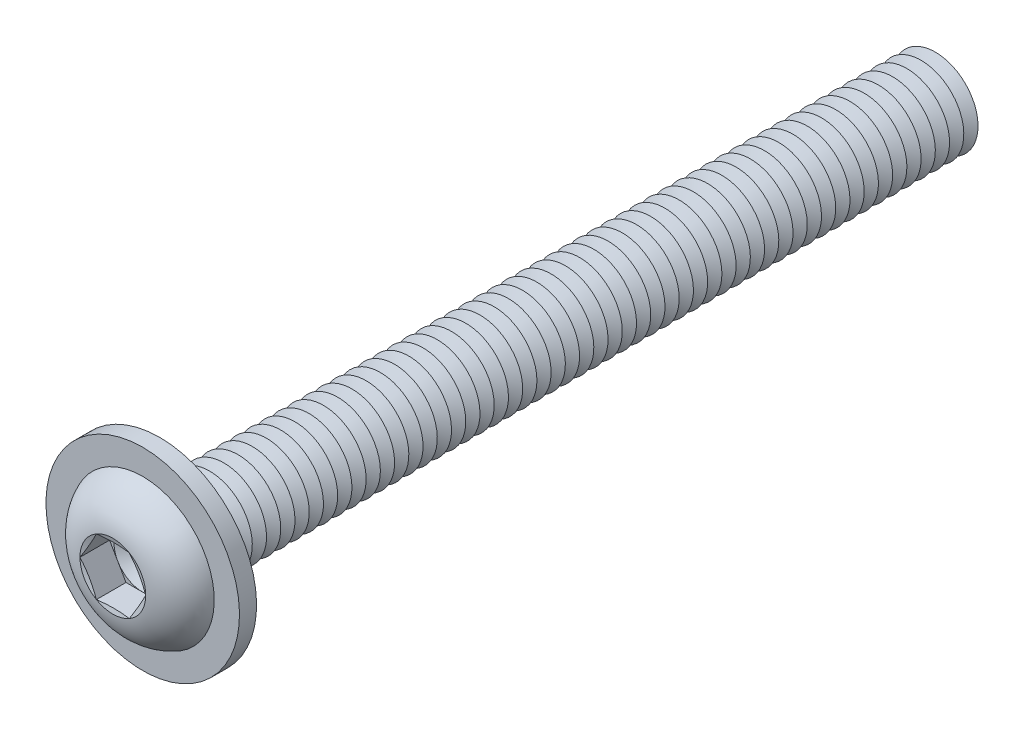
from build123d import *

# Parameters (mm, degrees)
FILLET1_R           = 0.5
LPATTERN1_COUNT     = 55
LPATTERN1_PITCH     = 1
CUT_EXTRUDE1_DEPTH  = 2.08
SKETCH5_R           = 6.8
SKETCH5_R_2         = 3.5
BOSS_EXTRUDE1_DEPTH = 1.2


with BuildPart() as part:
    # Sketch1 → Revolve1 (revolve)
    with BuildSketch(Plane(origin=(0, 0, 0), x_dir=(0, 0, -1), z_dir=(1, 0, 0))):
        with BuildLine():
            Line((0, 3), (0, 5.25))
            ThreePointArc((0, 5.25), (-2.210041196, 4.408189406), (-3.3, 2.3094))
            Line((-3.3, 2.3094), (-2.990599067, 1.1547))
            Line((-2.990599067, 1.1547), (-3.3, 1.1547))
            Line((-3.3, 1.1547), (-3.3, 0))
            Line((-3.3, 0), (55, 0))
            Line((55, 0), (55, 3))
            Line((55, 3), (0, 3))
        make_face()
    revolve(axis=Axis((0, 0, -55), (0, 0, 1)))

    # Fillet1
    fillet1_edges = [part.edges().sort_by_distance(p)[0] for p in [
        (0, -3, 0),
    ]]
    fillet(fillet1_edges, radius=FILLET1_R)

    # Sketch2 → Cut-Revolve1 (revolve, cut)
    with BuildSketch(Plane(origin=(0, 0, 0), x_dir=(0, 0, -1), z_dir=(1, 0, 0))):
        Polygon((54.5, 3), (55.5, 3), (55, 2.133974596), align=None)
    cut_revolve1 = revolve(axis=Axis((0, 0, -55), (0, 0, -1)), mode=Mode.SUBTRACT)

    # LPattern1: Cut-Revolve1 ×55
    with Locations(*[(0, 0, i * LPATTERN1_PITCH) for i in range(1, LPATTERN1_COUNT)]):
        add(cut_revolve1, mode=Mode.SUBTRACT)

    # Sketch3 → Cut-Extrude1 (cut)
    with BuildSketch(Plane.XY.offset(3.3)):
        Polygon((1.1547, 1.999999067), (-1.1547, 1.999999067), (-2.3094, 0), (-1.1547, -1.999999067), (1.1547, -1.999999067), (2.3094, 0), align=None)
    extrude(amount=-CUT_EXTRUDE1_DEPTH, mode=Mode.SUBTRACT)

    # Cut-Extrude2 cone 1 section (on through the dimple's axis) → Cut-Extrude2 (revolve, cut)
    with BuildSketch(Plane(origin=(0, 0, 1.22), x_dir=(0, -1, 0), z_dir=(1, 0, 0))):
        Polygon((0, 0), (1.999999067, 0), (0, 1.1547), align=None)
    revolve(axis=Axis((0, 0, 1.22), (0, 0, -1)), mode=Mode.SUBTRACT)

    # Sketch5 → Boss-Extrude1 (add)
    with BuildSketch(Plane(origin=(0, 0, 0), x_dir=(-1, 0, 0), z_dir=(0, 0, -1))):
        with Locations(Location((0, 0, 0), (0, 0, 90))):
            Circle(SKETCH5_R)
        Circle(SKETCH5_R_2, mode=Mode.SUBTRACT)
    extrude(amount=-BOSS_EXTRUDE1_DEPTH)


solid = part.part
